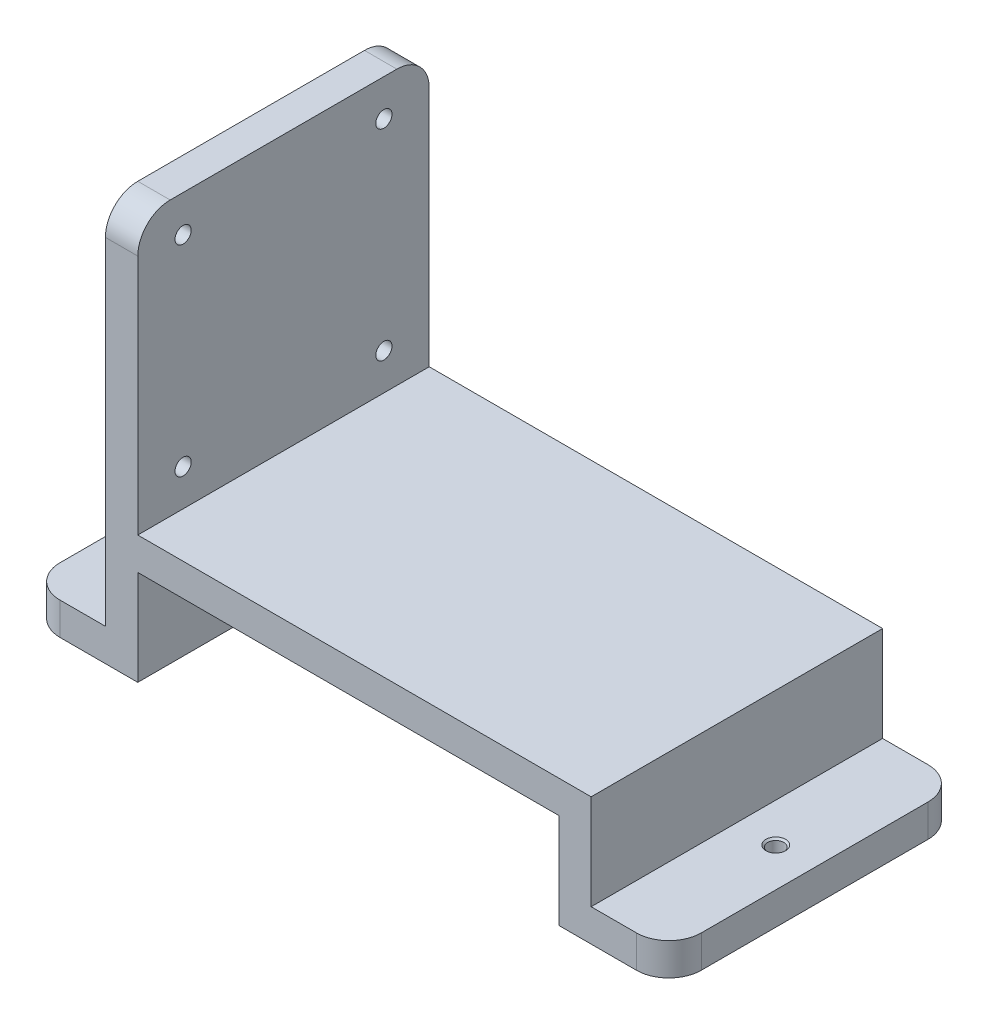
ISO-10303-21;
HEADER;
FILE_DESCRIPTION(('STEP AP214'),'2;1');
FILE_NAME('part.step','',(''),(''),'','','');
FILE_SCHEMA(('AUTOMOTIVE_DESIGN { 1 0 10303 214 1 1 1 1 }'));
ENDSEC;
DATA;
#1=APPLICATION_CONTEXT('core data for automotive mechanical design processes');
#2=APPLICATION_PROTOCOL_DEFINITION('international standard','automotive_design',2000,#1);
#3=PRODUCT_CONTEXT('',#1,'mechanical');
#4=PRODUCT('Part','Part','',(#3));
#5=PRODUCT_RELATED_PRODUCT_CATEGORY('part','',(#4));
#6=PRODUCT_DEFINITION_FORMATION('','',#4);
#7=PRODUCT_DEFINITION_CONTEXT('part definition',#1,'design');
#8=PRODUCT_DEFINITION('design','',#6,#7);
#9=PRODUCT_DEFINITION_SHAPE('','',#8);
#10=(LENGTH_UNIT() NAMED_UNIT(*) SI_UNIT(.MILLI.,.METRE.));
#11=(NAMED_UNIT(*) PLANE_ANGLE_UNIT() SI_UNIT($,.RADIAN.));
#12=(NAMED_UNIT(*) SI_UNIT($,.STERADIAN.) SOLID_ANGLE_UNIT());
#13=UNCERTAINTY_MEASURE_WITH_UNIT(LENGTH_MEASURE(1.E-05),#10,'distance_accuracy_value','');
#14=(GEOMETRIC_REPRESENTATION_CONTEXT(3) GLOBAL_UNCERTAINTY_ASSIGNED_CONTEXT((#13)) GLOBAL_UNIT_ASSIGNED_CONTEXT((#10,
#11,#12)) REPRESENTATION_CONTEXT('',''));
#15=CARTESIAN_POINT('',(0.,0.,0.));
#16=DIRECTION('',(0.,0.,1.));
#17=DIRECTION('',(1.,0.,0.));
#18=AXIS2_PLACEMENT_3D('',#15,#16,#17);
#19=CARTESIAN_POINT('',(-37.5,-9.7,45.));
#20=DIRECTION('',(1.,0.,0.));
#21=DIRECTION('',(0.,0.,-1.));
#22=AXIS2_PLACEMENT_3D('',#19,#20,#21);
#23=PLANE('',#22);
#24=CARTESIAN_POINT('',(-37.5,41.65,7.00000000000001));
#25=DIRECTION('',(-1.,0.,0.));
#26=DIRECTION('',(0.,0.,1.));
#27=AXIS2_PLACEMENT_3D('',#24,#25,#26);
#28=CIRCLE('',#27,1.525);
#29=CARTESIAN_POINT('',(-37.5,41.65,8.52500000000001));
#30=VERTEX_POINT('',#29);
#31=EDGE_CURVE('E754',#30,#30,#28,.T.);
#32=ORIENTED_EDGE('',*,*,#31,.F.);
#33=EDGE_LOOP('',(#32));
#34=FACE_BOUND('',#33,.T.);
#35=CARTESIAN_POINT('',(-37.5,10.65,7.));
#36=DIRECTION('',(-1.,0.,0.));
#37=DIRECTION('',(0.,0.,1.));
#38=AXIS2_PLACEMENT_3D('',#35,#36,#37);
#39=CIRCLE('',#38,1.525);
#40=CARTESIAN_POINT('',(-37.5,10.65,8.525));
#41=VERTEX_POINT('',#40);
#42=EDGE_CURVE('E364',#41,#41,#39,.T.);
#43=ORIENTED_EDGE('',*,*,#42,.F.);
#44=EDGE_LOOP('',(#43));
#45=FACE_BOUND('',#44,.T.);
#46=CARTESIAN_POINT('',(-37.5,41.65,38.));
#47=DIRECTION('',(-1.,0.,0.));
#48=DIRECTION('',(0.,0.,1.));
#49=AXIS2_PLACEMENT_3D('',#46,#47,#48);
#50=CIRCLE('',#49,1.525);
#51=CARTESIAN_POINT('',(-37.5,41.65,39.525));
#52=VERTEX_POINT('',#51);
#53=EDGE_CURVE('E353',#52,#52,#50,.T.);
#54=ORIENTED_EDGE('',*,*,#53,.F.);
#55=EDGE_LOOP('',(#54));
#56=FACE_BOUND('',#55,.T.);
#57=DIRECTION('',(0.,0.,-1.));
#58=VECTOR('',#57,1.);
#59=CARTESIAN_POINT('',(-37.5,47.3,45.));
#60=LINE('',#59,#58);
#61=CARTESIAN_POINT('',(-37.5,47.3,40.));
#62=VERTEX_POINT('',#61);
#63=CARTESIAN_POINT('',(-37.5,47.3,5.00000000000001));
#64=VERTEX_POINT('',#63);
#65=EDGE_CURVE('E208',#62,#64,#60,.T.);
#66=ORIENTED_EDGE('',*,*,#65,.T.);
#67=CARTESIAN_POINT('',(-37.5,42.3,5.));
#68=DIRECTION('',(1.,0.,0.));
#69=DIRECTION('',(0.,0.,-1.));
#70=AXIS2_PLACEMENT_3D('',#67,#68,#69);
#71=CIRCLE('',#70,5.);
#72=CARTESIAN_POINT('',(-37.5,42.3,0.));
#73=VERTEX_POINT('',#72);
#74=EDGE_CURVE('E331',#64,#73,#71,.F.);
#75=ORIENTED_EDGE('',*,*,#74,.T.);
#76=DIRECTION('',(0.,-1.,0.));
#77=VECTOR('',#76,1.);
#78=CARTESIAN_POINT('',(-37.5,-9.7,0.));
#79=LINE('',#78,#77);
#80=CARTESIAN_POINT('',(-37.5,-9.7,0.));
#81=VERTEX_POINT('',#80);
#82=EDGE_CURVE('E206',#73,#81,#79,.T.);
#83=ORIENTED_EDGE('',*,*,#82,.T.);
#84=DIRECTION('',(0.,0.,-1.));
#85=VECTOR('',#84,1.);
#86=CARTESIAN_POINT('',(-37.5,-9.7,45.));
#87=LINE('',#86,#85);
#88=CARTESIAN_POINT('',(-37.5,-9.7,45.));
#89=VERTEX_POINT('',#88);
#90=EDGE_CURVE('E202',#89,#81,#87,.T.);
#91=ORIENTED_EDGE('',*,*,#90,.F.);
#92=DIRECTION('',(0.,-1.,0.));
#93=VECTOR('',#92,1.);
#94=CARTESIAN_POINT('',(-37.5,-9.7,45.));
#95=LINE('',#94,#93);
#96=CARTESIAN_POINT('',(-37.5,42.3,45.));
#97=VERTEX_POINT('',#96);
#98=EDGE_CURVE('E187',#97,#89,#95,.T.);
#99=ORIENTED_EDGE('',*,*,#98,.F.);
#100=CARTESIAN_POINT('',(-37.5,42.3,40.));
#101=DIRECTION('',(1.,0.,0.));
#102=DIRECTION('',(0.,0.,-1.));
#103=AXIS2_PLACEMENT_3D('',#100,#101,#102);
#104=CIRCLE('',#103,5.);
#105=EDGE_CURVE('E329',#97,#62,#104,.F.);
#106=ORIENTED_EDGE('',*,*,#105,.T.);
#107=EDGE_LOOP('',(#66,#75,#83,#91,#99,#106));
#108=FACE_BOUND('',#107,.T.);
#109=CARTESIAN_POINT('',(-37.5,10.65,38.));
#110=DIRECTION('',(-1.,0.,0.));
#111=DIRECTION('',(0.,0.,1.));
#112=AXIS2_PLACEMENT_3D('',#109,#110,#111);
#113=CIRCLE('',#112,1.525);
#114=CARTESIAN_POINT('',(-37.5,10.65,39.525));
#115=VERTEX_POINT('',#114);
#116=EDGE_CURVE('E357',#115,#115,#113,.T.);
#117=ORIENTED_EDGE('',*,*,#116,.F.);
#118=EDGE_LOOP('',(#117));
#119=FACE_BOUND('',#118,.T.);
#120=ADVANCED_FACE('F47',(#34,#45,#56,#108,#119),#23,.F.);
#121=CARTESIAN_POINT('',(-32.5,47.3,45.));
#122=DIRECTION('',(-1.,0.,0.));
#123=DIRECTION('',(0.,-1.,0.));
#124=AXIS2_PLACEMENT_3D('',#121,#122,#123);
#125=PLANE('',#124);
#126=CARTESIAN_POINT('',(-32.5,41.65,7.00000000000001));
#127=DIRECTION('',(-1.,0.,0.));
#128=DIRECTION('',(0.,-1.,0.));
#129=AXIS2_PLACEMENT_3D('',#126,#127,#128);
#130=CIRCLE('',#129,1.24999999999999);
#131=CARTESIAN_POINT('',(-32.5,40.4,7.00000000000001));
#132=VERTEX_POINT('',#131);
#133=EDGE_CURVE('E51',#132,#132,#130,.T.);
#134=ORIENTED_EDGE('',*,*,#133,.T.);
#135=EDGE_LOOP('',(#134));
#136=FACE_BOUND('',#135,.T.);
#137=CARTESIAN_POINT('',(-32.5,10.65,7.));
#138=DIRECTION('',(-1.,0.,0.));
#139=DIRECTION('',(0.,-1.,0.));
#140=AXIS2_PLACEMENT_3D('',#137,#138,#139);
#141=CIRCLE('',#140,1.24999999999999);
#142=CARTESIAN_POINT('',(-32.5,9.40000000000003,7.));
#143=VERTEX_POINT('',#142);
#144=EDGE_CURVE('E355',#143,#143,#141,.T.);
#145=ORIENTED_EDGE('',*,*,#144,.T.);
#146=EDGE_LOOP('',(#145));
#147=FACE_BOUND('',#146,.T.);
#148=CARTESIAN_POINT('',(-32.5,10.65,38.));
#149=DIRECTION('',(-1.,0.,0.));
#150=DIRECTION('',(0.,-1.,0.));
#151=AXIS2_PLACEMENT_3D('',#148,#149,#150);
#152=CIRCLE('',#151,1.24999999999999);
#153=CARTESIAN_POINT('',(-32.5,9.40000000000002,38.));
#154=VERTEX_POINT('',#153);
#155=EDGE_CURVE('E351',#154,#154,#152,.T.);
#156=ORIENTED_EDGE('',*,*,#155,.T.);
#157=EDGE_LOOP('',(#156));
#158=FACE_BOUND('',#157,.T.);
#159=CARTESIAN_POINT('',(-32.5,41.65,38.));
#160=DIRECTION('',(-1.,0.,0.));
#161=DIRECTION('',(0.,-1.,0.));
#162=AXIS2_PLACEMENT_3D('',#159,#160,#161);
#163=CIRCLE('',#162,1.24999999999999);
#164=CARTESIAN_POINT('',(-32.5,40.4,38.));
#165=VERTEX_POINT('',#164);
#166=EDGE_CURVE('E346',#165,#165,#163,.T.);
#167=ORIENTED_EDGE('',*,*,#166,.T.);
#168=EDGE_LOOP('',(#167));
#169=FACE_BOUND('',#168,.T.);
#170=DIRECTION('',(0.,1.,0.));
#171=VECTOR('',#170,1.);
#172=CARTESIAN_POINT('',(-32.5,47.3,0.));
#173=LINE('',#172,#171);
#174=CARTESIAN_POINT('',(-32.5,5.00000000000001,0.));
#175=VERTEX_POINT('',#174);
#176=CARTESIAN_POINT('',(-32.5,42.3,0.));
#177=VERTEX_POINT('',#176);
#178=EDGE_CURVE('E233',#175,#177,#173,.T.);
#179=ORIENTED_EDGE('',*,*,#178,.T.);
#180=CARTESIAN_POINT('',(-32.5,42.3,5.));
#181=DIRECTION('',(-1.,0.,0.));
#182=DIRECTION('',(0.,-1.,0.));
#183=AXIS2_PLACEMENT_3D('',#180,#181,#182);
#184=CIRCLE('',#183,5.);
#185=CARTESIAN_POINT('',(-32.5,47.3,5.00000000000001));
#186=VERTEX_POINT('',#185);
#187=EDGE_CURVE('E335',#177,#186,#184,.F.);
#188=ORIENTED_EDGE('',*,*,#187,.T.);
#189=DIRECTION('',(0.,0.,-1.));
#190=VECTOR('',#189,1.);
#191=CARTESIAN_POINT('',(-32.5,47.3,45.));
#192=LINE('',#191,#190);
#193=CARTESIAN_POINT('',(-32.5,47.3,40.));
#194=VERTEX_POINT('',#193);
#195=EDGE_CURVE('E288',#194,#186,#192,.T.);
#196=ORIENTED_EDGE('',*,*,#195,.F.);
#197=CARTESIAN_POINT('',(-32.5,42.3,40.));
#198=DIRECTION('',(-1.,0.,0.));
#199=DIRECTION('',(0.,-1.,0.));
#200=AXIS2_PLACEMENT_3D('',#197,#198,#199);
#201=CIRCLE('',#200,5.);
#202=CARTESIAN_POINT('',(-32.5,42.3,45.));
#203=VERTEX_POINT('',#202);
#204=EDGE_CURVE('E333',#194,#203,#201,.F.);
#205=ORIENTED_EDGE('',*,*,#204,.T.);
#206=DIRECTION('',(0.,1.,0.));
#207=VECTOR('',#206,1.);
#208=CARTESIAN_POINT('',(-32.5,47.3,45.));
#209=LINE('',#208,#207);
#210=CARTESIAN_POINT('',(-32.5,5.00000000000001,45.));
#211=VERTEX_POINT('',#210);
#212=EDGE_CURVE('E199',#211,#203,#209,.T.);
#213=ORIENTED_EDGE('',*,*,#212,.F.);
#214=DIRECTION('',(0.,0.,-1.));
#215=VECTOR('',#214,1.);
#216=CARTESIAN_POINT('',(-32.5,5.00000000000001,45.));
#217=LINE('',#216,#215);
#218=EDGE_CURVE('E232',#211,#175,#217,.T.);
#219=ORIENTED_EDGE('',*,*,#218,.T.);
#220=EDGE_LOOP('',(#179,#188,#196,#205,#213,#219));
#221=FACE_BOUND('',#220,.T.);
#222=ADVANCED_FACE('F455',(#136,#147,#158,#169,#221),#125,.F.);
#223=CARTESIAN_POINT('',(-37.5,47.3,45.));
#224=DIRECTION('',(0.,-1.,0.));
#225=DIRECTION('',(1.,0.,0.));
#226=AXIS2_PLACEMENT_3D('',#223,#224,#225);
#227=PLANE('',#226);
#228=ORIENTED_EDGE('',*,*,#195,.T.);
#229=DIRECTION('',(-1.,0.,0.));
#230=VECTOR('',#229,1.);
#231=CARTESIAN_POINT('',(-37.5,47.3,5.));
#232=LINE('',#231,#230);
#233=EDGE_CURVE('E326',#186,#64,#232,.T.);
#234=ORIENTED_EDGE('',*,*,#233,.T.);
#235=ORIENTED_EDGE('',*,*,#65,.F.);
#236=DIRECTION('',(-1.,0.,0.));
#237=VECTOR('',#236,1.);
#238=CARTESIAN_POINT('',(-32.5,47.3,40.));
#239=LINE('',#238,#237);
#240=EDGE_CURVE('E324',#62,#194,#239,.F.);
#241=ORIENTED_EDGE('',*,*,#240,.T.);
#242=EDGE_LOOP('',(#228,#234,#235,#241));
#243=FACE_BOUND('',#242,.T.);
#244=ADVANCED_FACE('F395',(#243),#227,.F.);
#245=CARTESIAN_POINT('',(-49.5,-9.7,45.));
#246=DIRECTION('',(0.,-1.,0.));
#247=DIRECTION('',(0.,0.,-1.));
#248=AXIS2_PLACEMENT_3D('',#245,#246,#247);
#249=PLANE('',#248);
#250=CARTESIAN_POINT('',(-43.5,-9.69999999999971,22.5));
#251=DIRECTION('',(0.,1.,0.));
#252=DIRECTION('',(0.,0.,1.));
#253=AXIS2_PLACEMENT_3D('',#250,#251,#252);
#254=CIRCLE('',#253,1.525);
#255=CARTESIAN_POINT('',(-43.5,-9.69999999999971,24.025));
#256=VERTEX_POINT('',#255);
#257=EDGE_CURVE('E298',#256,#256,#254,.T.);
#258=ORIENTED_EDGE('',*,*,#257,.F.);
#259=EDGE_LOOP('',(#258));
#260=FACE_BOUND('',#259,.T.);
#261=DIRECTION('',(-1.,0.,0.));
#262=VECTOR('',#261,1.);
#263=CARTESIAN_POINT('',(-49.5,-9.7,0.));
#264=LINE('',#263,#262);
#265=CARTESIAN_POINT('',(-44.5,-9.7,0.));
#266=VERTEX_POINT('',#265);
#267=EDGE_CURVE('E238',#81,#266,#264,.T.);
#268=ORIENTED_EDGE('',*,*,#267,.T.);
#269=CARTESIAN_POINT('',(-44.5,-9.7,5.));
#270=DIRECTION('',(0.,-1.,0.));
#271=DIRECTION('',(0.,0.,-1.));
#272=AXIS2_PLACEMENT_3D('',#269,#270,#271);
#273=CIRCLE('',#272,5.);
#274=CARTESIAN_POINT('',(-49.5,-9.7,5.00000000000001));
#275=VERTEX_POINT('',#274);
#276=EDGE_CURVE('E11',#266,#275,#273,.F.);
#277=ORIENTED_EDGE('',*,*,#276,.T.);
#278=DIRECTION('',(0.,0.,-1.));
#279=VECTOR('',#278,1.);
#280=CARTESIAN_POINT('',(-49.5,-9.7,45.));
#281=LINE('',#280,#279);
#282=CARTESIAN_POINT('',(-49.5,-9.7,40.));
#283=VERTEX_POINT('',#282);
#284=EDGE_CURVE('E209',#283,#275,#281,.T.);
#285=ORIENTED_EDGE('',*,*,#284,.F.);
#286=CARTESIAN_POINT('',(-44.5,-9.7,40.));
#287=DIRECTION('',(0.,-1.,0.));
#288=DIRECTION('',(0.,0.,-1.));
#289=AXIS2_PLACEMENT_3D('',#286,#287,#288);
#290=CIRCLE('',#289,5.);
#291=CARTESIAN_POINT('',(-44.5,-9.7,45.));
#292=VERTEX_POINT('',#291);
#293=EDGE_CURVE('E56',#283,#292,#290,.F.);
#294=ORIENTED_EDGE('',*,*,#293,.T.);
#295=DIRECTION('',(-1.,0.,0.));
#296=VECTOR('',#295,1.);
#297=CARTESIAN_POINT('',(-49.5,-9.7,45.));
#298=LINE('',#297,#296);
#299=EDGE_CURVE('E193',#89,#292,#298,.T.);
#300=ORIENTED_EDGE('',*,*,#299,.F.);
#301=ORIENTED_EDGE('',*,*,#90,.T.);
#302=EDGE_LOOP('',(#268,#277,#285,#294,#300,#301));
#303=FACE_BOUND('',#302,.T.);
#304=ADVANCED_FACE('F211',(#260,#303),#249,.F.);
#305=CARTESIAN_POINT('',(-49.5,-14.7,45.));
#306=DIRECTION('',(1.,0.,0.));
#307=DIRECTION('',(0.,0.,-1.));
#308=AXIS2_PLACEMENT_3D('',#305,#306,#307);
#309=PLANE('',#308);
#310=ORIENTED_EDGE('',*,*,#284,.T.);
#311=DIRECTION('',(0.,-1.,0.));
#312=VECTOR('',#311,1.);
#313=CARTESIAN_POINT('',(-49.5,-14.7,5.));
#314=LINE('',#313,#312);
#315=CARTESIAN_POINT('',(-49.5,-14.7,5.00000000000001));
#316=VERTEX_POINT('',#315);
#317=EDGE_CURVE('E338',#275,#316,#314,.T.);
#318=ORIENTED_EDGE('',*,*,#317,.T.);
#319=DIRECTION('',(0.,0.,-1.));
#320=VECTOR('',#319,1.);
#321=CARTESIAN_POINT('',(-49.5,-14.7,45.));
#322=LINE('',#321,#320);
#323=CARTESIAN_POINT('',(-49.5,-14.7,40.));
#324=VERTEX_POINT('',#323);
#325=EDGE_CURVE('E283',#324,#316,#322,.T.);
#326=ORIENTED_EDGE('',*,*,#325,.F.);
#327=DIRECTION('',(0.,-1.,0.));
#328=VECTOR('',#327,1.);
#329=CARTESIAN_POINT('',(-49.5,-9.7,40.));
#330=LINE('',#329,#328);
#331=EDGE_CURVE('E69',#324,#283,#330,.F.);
#332=ORIENTED_EDGE('',*,*,#331,.T.);
#333=EDGE_LOOP('',(#310,#318,#326,#332));
#334=FACE_BOUND('',#333,.T.);
#335=ADVANCED_FACE('F411',(#334),#309,.F.);
#336=CARTESIAN_POINT('',(-32.5,-14.7,45.));
#337=DIRECTION('',(0.,1.,0.));
#338=DIRECTION('',(-1.,0.,0.));
#339=AXIS2_PLACEMENT_3D('',#336,#337,#338);
#340=PLANE('',#339);
#341=CARTESIAN_POINT('',(-43.5,-14.7,22.5));
#342=DIRECTION('',(0.,1.,0.));
#343=DIRECTION('',(-1.,0.,0.));
#344=AXIS2_PLACEMENT_3D('',#341,#342,#343);
#345=CIRCLE('',#344,1.25);
#346=CARTESIAN_POINT('',(-44.75,-14.7,22.5));
#347=VERTEX_POINT('',#346);
#348=EDGE_CURVE('E236',#347,#347,#345,.T.);
#349=ORIENTED_EDGE('',*,*,#348,.T.);
#350=EDGE_LOOP('',(#349));
#351=FACE_BOUND('',#350,.T.);
#352=ORIENTED_EDGE('',*,*,#325,.T.);
#353=CARTESIAN_POINT('',(-44.5,-14.7,5.));
#354=DIRECTION('',(0.,1.,0.));
#355=DIRECTION('',(-1.,0.,0.));
#356=AXIS2_PLACEMENT_3D('',#353,#354,#355);
#357=CIRCLE('',#356,5.);
#358=CARTESIAN_POINT('',(-44.5,-14.7,0.));
#359=VERTEX_POINT('',#358);
#360=EDGE_CURVE('E343',#316,#359,#357,.F.);
#361=ORIENTED_EDGE('',*,*,#360,.T.);
#362=DIRECTION('',(1.,0.,0.));
#363=VECTOR('',#362,1.);
#364=CARTESIAN_POINT('',(-32.5,-14.7,0.));
#365=LINE('',#364,#363);
#366=CARTESIAN_POINT('',(-32.5,-14.7,0.));
#367=VERTEX_POINT('',#366);
#368=EDGE_CURVE('E240',#359,#367,#365,.T.);
#369=ORIENTED_EDGE('',*,*,#368,.T.);
#370=DIRECTION('',(0.,0.,-1.));
#371=VECTOR('',#370,1.);
#372=CARTESIAN_POINT('',(-32.5,-14.7,45.));
#373=LINE('',#372,#371);
#374=CARTESIAN_POINT('',(-32.5,-14.7,45.));
#375=VERTEX_POINT('',#374);
#376=EDGE_CURVE('E280',#375,#367,#373,.T.);
#377=ORIENTED_EDGE('',*,*,#376,.F.);
#378=DIRECTION('',(1.,0.,0.));
#379=VECTOR('',#378,1.);
#380=CARTESIAN_POINT('',(-32.5,-14.7,45.));
#381=LINE('',#380,#379);
#382=CARTESIAN_POINT('',(-44.5,-14.7,45.));
#383=VERTEX_POINT('',#382);
#384=EDGE_CURVE('E213',#383,#375,#381,.T.);
#385=ORIENTED_EDGE('',*,*,#384,.F.);
#386=CARTESIAN_POINT('',(-44.5,-14.7,40.));
#387=DIRECTION('',(0.,1.,0.));
#388=DIRECTION('',(-1.,0.,0.));
#389=AXIS2_PLACEMENT_3D('',#386,#387,#388);
#390=CIRCLE('',#389,5.);
#391=EDGE_CURVE('E341',#383,#324,#390,.F.);
#392=ORIENTED_EDGE('',*,*,#391,.T.);
#393=EDGE_LOOP('',(#352,#361,#369,#377,#385,#392));
#394=FACE_BOUND('',#393,.T.);
#395=ADVANCED_FACE('F413',(#351,#394),#340,.F.);
#396=CARTESIAN_POINT('',(-32.5,0.,45.));
#397=DIRECTION('',(-1.,0.,0.));
#398=DIRECTION('',(0.,-1.,0.));
#399=AXIS2_PLACEMENT_3D('',#396,#397,#398);
#400=PLANE('',#399);
#401=DIRECTION('',(0.,1.,0.));
#402=VECTOR('',#401,1.);
#403=CARTESIAN_POINT('',(-32.5,0.,0.));
#404=LINE('',#403,#402);
#405=CARTESIAN_POINT('',(-32.5,0.,0.));
#406=VERTEX_POINT('',#405);
#407=EDGE_CURVE('E242',#367,#406,#404,.T.);
#408=ORIENTED_EDGE('',*,*,#407,.T.);
#409=DIRECTION('',(0.,0.,-1.));
#410=VECTOR('',#409,1.);
#411=CARTESIAN_POINT('',(-32.5,0.,45.));
#412=LINE('',#411,#410);
#413=CARTESIAN_POINT('',(-32.5,0.,45.));
#414=VERTEX_POINT('',#413);
#415=EDGE_CURVE('E277',#414,#406,#412,.T.);
#416=ORIENTED_EDGE('',*,*,#415,.F.);
#417=DIRECTION('',(0.,1.,0.));
#418=VECTOR('',#417,1.);
#419=CARTESIAN_POINT('',(-32.5,0.,45.));
#420=LINE('',#419,#418);
#421=EDGE_CURVE('E215',#375,#414,#420,.T.);
#422=ORIENTED_EDGE('',*,*,#421,.F.);
#423=ORIENTED_EDGE('',*,*,#376,.T.);
#424=EDGE_LOOP('',(#408,#416,#422,#423));
#425=FACE_BOUND('',#424,.T.);
#426=ADVANCED_FACE('F421',(#425),#400,.F.);
#427=CARTESIAN_POINT('',(-32.5,0.,45.));
#428=DIRECTION('',(0.,1.,0.));
#429=DIRECTION('',(0.,0.,1.));
#430=AXIS2_PLACEMENT_3D('',#427,#428,#429);
#431=PLANE('',#430);
#432=DIRECTION('',(1.,0.,0.));
#433=VECTOR('',#432,1.);
#434=CARTESIAN_POINT('',(-32.5,0.,0.));
#435=LINE('',#434,#433);
#436=CARTESIAN_POINT('',(32.5,0.,0.));
#437=VERTEX_POINT('',#436);
#438=EDGE_CURVE('E244',#406,#437,#435,.T.);
#439=ORIENTED_EDGE('',*,*,#438,.T.);
#440=DIRECTION('',(0.,0.,-1.));
#441=VECTOR('',#440,1.);
#442=CARTESIAN_POINT('',(32.5,0.,45.));
#443=LINE('',#442,#441);
#444=CARTESIAN_POINT('',(32.5,0.,45.));
#445=VERTEX_POINT('',#444);
#446=EDGE_CURVE('E274',#445,#437,#443,.T.);
#447=ORIENTED_EDGE('',*,*,#446,.F.);
#448=DIRECTION('',(1.,0.,0.));
#449=VECTOR('',#448,1.);
#450=CARTESIAN_POINT('',(-32.5,0.,45.));
#451=LINE('',#450,#449);
#452=EDGE_CURVE('E220',#414,#445,#451,.T.);
#453=ORIENTED_EDGE('',*,*,#452,.F.);
#454=ORIENTED_EDGE('',*,*,#415,.T.);
#455=EDGE_LOOP('',(#439,#447,#453,#454));
#456=FACE_BOUND('',#455,.T.);
#457=ADVANCED_FACE('F426',(#456),#431,.F.);
#458=CARTESIAN_POINT('',(32.5,-14.7,45.));
#459=DIRECTION('',(1.,0.,0.));
#460=DIRECTION('',(0.,1.,0.));
#461=AXIS2_PLACEMENT_3D('',#458,#459,#460);
#462=PLANE('',#461);
#463=DIRECTION('',(0.,-1.,0.));
#464=VECTOR('',#463,1.);
#465=CARTESIAN_POINT('',(32.5,-14.7,0.));
#466=LINE('',#465,#464);
#467=CARTESIAN_POINT('',(32.5,-14.7,0.));
#468=VERTEX_POINT('',#467);
#469=EDGE_CURVE('E246',#437,#468,#466,.T.);
#470=ORIENTED_EDGE('',*,*,#469,.T.);
#471=DIRECTION('',(0.,0.,-1.));
#472=VECTOR('',#471,1.);
#473=CARTESIAN_POINT('',(32.5,-14.7,45.));
#474=LINE('',#473,#472);
#475=CARTESIAN_POINT('',(32.5,-14.7,45.));
#476=VERTEX_POINT('',#475);
#477=EDGE_CURVE('E271',#476,#468,#474,.T.);
#478=ORIENTED_EDGE('',*,*,#477,.F.);
#479=DIRECTION('',(0.,-1.,0.));
#480=VECTOR('',#479,1.);
#481=CARTESIAN_POINT('',(32.5,-14.7,45.));
#482=LINE('',#481,#480);
#483=EDGE_CURVE('E222',#445,#476,#482,.T.);
#484=ORIENTED_EDGE('',*,*,#483,.F.);
#485=ORIENTED_EDGE('',*,*,#446,.T.);
#486=EDGE_LOOP('',(#470,#478,#484,#485));
#487=FACE_BOUND('',#486,.T.);
#488=ADVANCED_FACE('F432',(#487),#462,.F.);
#489=CARTESIAN_POINT('',(49.5,-14.7,45.));
#490=DIRECTION('',(0.,1.,0.));
#491=DIRECTION('',(-1.,0.,0.));
#492=AXIS2_PLACEMENT_3D('',#489,#490,#491);
#493=PLANE('',#492);
#494=CARTESIAN_POINT('',(43.5,-14.7,22.5));
#495=DIRECTION('',(0.,1.,0.));
#496=DIRECTION('',(-1.,0.,0.));
#497=AXIS2_PLACEMENT_3D('',#494,#495,#496);
#498=CIRCLE('',#497,1.25);
#499=CARTESIAN_POINT('',(42.25,-14.7,22.5));
#500=VERTEX_POINT('',#499);
#501=EDGE_CURVE('E295',#500,#500,#498,.T.);
#502=ORIENTED_EDGE('',*,*,#501,.T.);
#503=EDGE_LOOP('',(#502));
#504=FACE_BOUND('',#503,.T.);
#505=DIRECTION('',(1.,0.,0.));
#506=VECTOR('',#505,1.);
#507=CARTESIAN_POINT('',(49.5,-14.7,0.));
#508=LINE('',#507,#506);
#509=CARTESIAN_POINT('',(44.5,-14.7,0.));
#510=VERTEX_POINT('',#509);
#511=EDGE_CURVE('E248',#468,#510,#508,.T.);
#512=ORIENTED_EDGE('',*,*,#511,.T.);
#513=CARTESIAN_POINT('',(44.5,-14.7,5.));
#514=DIRECTION('',(0.,1.,0.));
#515=DIRECTION('',(-1.,0.,0.));
#516=AXIS2_PLACEMENT_3D('',#513,#514,#515);
#517=CIRCLE('',#516,5.);
#518=CARTESIAN_POINT('',(49.5,-14.7,5.00000000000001));
#519=VERTEX_POINT('',#518);
#520=EDGE_CURVE('E316',#510,#519,#517,.F.);
#521=ORIENTED_EDGE('',*,*,#520,.T.);
#522=DIRECTION('',(0.,0.,-1.));
#523=VECTOR('',#522,1.);
#524=CARTESIAN_POINT('',(49.5,-14.7,45.));
#525=LINE('',#524,#523);
#526=CARTESIAN_POINT('',(49.5,-14.7,40.));
#527=VERTEX_POINT('',#526);
#528=EDGE_CURVE('E268',#527,#519,#525,.T.);
#529=ORIENTED_EDGE('',*,*,#528,.F.);
#530=CARTESIAN_POINT('',(44.5,-14.7,40.));
#531=DIRECTION('',(0.,1.,0.));
#532=DIRECTION('',(-1.,0.,0.));
#533=AXIS2_PLACEMENT_3D('',#530,#531,#532);
#534=CIRCLE('',#533,5.);
#535=CARTESIAN_POINT('',(44.5,-14.7,45.));
#536=VERTEX_POINT('',#535);
#537=EDGE_CURVE('E314',#527,#536,#534,.F.);
#538=ORIENTED_EDGE('',*,*,#537,.T.);
#539=DIRECTION('',(1.,0.,0.));
#540=VECTOR('',#539,1.);
#541=CARTESIAN_POINT('',(49.5,-14.7,45.));
#542=LINE('',#541,#540);
#543=EDGE_CURVE('E224',#476,#536,#542,.T.);
#544=ORIENTED_EDGE('',*,*,#543,.F.);
#545=ORIENTED_EDGE('',*,*,#477,.T.);
#546=EDGE_LOOP('',(#512,#521,#529,#538,#544,#545));
#547=FACE_BOUND('',#546,.T.);
#548=ADVANCED_FACE('F436',(#504,#547),#493,.F.);
#549=CARTESIAN_POINT('',(49.5,-9.7,45.));
#550=DIRECTION('',(-1.,0.,0.));
#551=DIRECTION('',(0.,0.,1.));
#552=AXIS2_PLACEMENT_3D('',#549,#550,#551);
#553=PLANE('',#552);
#554=ORIENTED_EDGE('',*,*,#528,.T.);
#555=DIRECTION('',(0.,1.,0.));
#556=VECTOR('',#555,1.);
#557=CARTESIAN_POINT('',(49.5,-9.7,5.));
#558=LINE('',#557,#556);
#559=CARTESIAN_POINT('',(49.5,-9.7,5.00000000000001));
#560=VERTEX_POINT('',#559);
#561=EDGE_CURVE('E301',#519,#560,#558,.T.);
#562=ORIENTED_EDGE('',*,*,#561,.T.);
#563=DIRECTION('',(0.,0.,-1.));
#564=VECTOR('',#563,1.);
#565=CARTESIAN_POINT('',(49.5,-9.7,45.));
#566=LINE('',#565,#564);
#567=CARTESIAN_POINT('',(49.5,-9.7,40.));
#568=VERTEX_POINT('',#567);
#569=EDGE_CURVE('E265',#568,#560,#566,.T.);
#570=ORIENTED_EDGE('',*,*,#569,.F.);
#571=DIRECTION('',(0.,1.,0.));
#572=VECTOR('',#571,1.);
#573=CARTESIAN_POINT('',(49.5,-14.7,40.));
#574=LINE('',#573,#572);
#575=EDGE_CURVE('E291',#568,#527,#574,.F.);
#576=ORIENTED_EDGE('',*,*,#575,.T.);
#577=EDGE_LOOP('',(#554,#562,#570,#576));
#578=FACE_BOUND('',#577,.T.);
#579=ADVANCED_FACE('F462',(#578),#553,.F.);
#580=CARTESIAN_POINT('',(37.5,-9.69999999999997,45.));
#581=DIRECTION('',(0.,-1.,0.));
#582=DIRECTION('',(1.,0.,0.));
#583=AXIS2_PLACEMENT_3D('',#580,#581,#582);
#584=PLANE('',#583);
#585=CARTESIAN_POINT('',(43.5,-9.69999999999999,22.5));
#586=DIRECTION('',(0.,1.,0.));
#587=DIRECTION('',(0.,0.,1.));
#588=AXIS2_PLACEMENT_3D('',#585,#586,#587);
#589=CIRCLE('',#588,1.525);
#590=CARTESIAN_POINT('',(43.5,-9.69999999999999,24.025));
#591=VERTEX_POINT('',#590);
#592=EDGE_CURVE('E349',#591,#591,#589,.T.);
#593=ORIENTED_EDGE('',*,*,#592,.F.);
#594=EDGE_LOOP('',(#593));
#595=FACE_BOUND('',#594,.T.);
#596=ORIENTED_EDGE('',*,*,#569,.T.);
#597=CARTESIAN_POINT('',(44.5,-9.69999999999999,5.));
#598=DIRECTION('',(0.,-1.,0.));
#599=DIRECTION('',(1.,0.,0.));
#600=AXIS2_PLACEMENT_3D('',#597,#598,#599);
#601=CIRCLE('',#600,5.);
#602=CARTESIAN_POINT('',(44.5,-9.69999999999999,0.));
#603=VERTEX_POINT('',#602);
#604=EDGE_CURVE('E306',#560,#603,#601,.F.);
#605=ORIENTED_EDGE('',*,*,#604,.T.);
#606=DIRECTION('',(-1.,0.,0.));
#607=VECTOR('',#606,1.);
#608=CARTESIAN_POINT('',(37.5,-9.69999999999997,0.));
#609=LINE('',#608,#607);
#610=CARTESIAN_POINT('',(37.5,-9.69999999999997,0.));
#611=VERTEX_POINT('',#610);
#612=EDGE_CURVE('E251',#603,#611,#609,.T.);
#613=ORIENTED_EDGE('',*,*,#612,.T.);
#614=DIRECTION('',(0.,0.,-1.));
#615=VECTOR('',#614,1.);
#616=CARTESIAN_POINT('',(37.5,-9.69999999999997,45.));
#617=LINE('',#616,#615);
#618=CARTESIAN_POINT('',(37.5,-9.69999999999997,45.));
#619=VERTEX_POINT('',#618);
#620=EDGE_CURVE('E262',#619,#611,#617,.T.);
#621=ORIENTED_EDGE('',*,*,#620,.F.);
#622=DIRECTION('',(-1.,0.,0.));
#623=VECTOR('',#622,1.);
#624=CARTESIAN_POINT('',(37.5,-9.69999999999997,45.));
#625=LINE('',#624,#623);
#626=CARTESIAN_POINT('',(44.5,-9.69999999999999,45.));
#627=VERTEX_POINT('',#626);
#628=EDGE_CURVE('E226',#627,#619,#625,.T.);
#629=ORIENTED_EDGE('',*,*,#628,.F.);
#630=CARTESIAN_POINT('',(44.5,-9.69999999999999,40.));
#631=DIRECTION('',(0.,-1.,0.));
#632=DIRECTION('',(1.,0.,0.));
#633=AXIS2_PLACEMENT_3D('',#630,#631,#632);
#634=CIRCLE('',#633,5.);
#635=EDGE_CURVE('E304',#627,#568,#634,.F.);
#636=ORIENTED_EDGE('',*,*,#635,.T.);
#637=EDGE_LOOP('',(#596,#605,#613,#621,#629,#636));
#638=FACE_BOUND('',#637,.T.);
#639=ADVANCED_FACE('F445',(#595,#638),#584,.F.);
#640=CARTESIAN_POINT('',(37.5,5.,45.));
#641=DIRECTION('',(-1.,0.,0.));
#642=DIRECTION('',(0.,0.,1.));
#643=AXIS2_PLACEMENT_3D('',#640,#641,#642);
#644=PLANE('',#643);
#645=DIRECTION('',(0.,1.,0.));
#646=VECTOR('',#645,1.);
#647=CARTESIAN_POINT('',(37.5,5.,0.));
#648=LINE('',#647,#646);
#649=CARTESIAN_POINT('',(37.5,5.,0.));
#650=VERTEX_POINT('',#649);
#651=EDGE_CURVE('E253',#611,#650,#648,.T.);
#652=ORIENTED_EDGE('',*,*,#651,.T.);
#653=DIRECTION('',(0.,0.,-1.));
#654=VECTOR('',#653,1.);
#655=CARTESIAN_POINT('',(37.5,5.,45.));
#656=LINE('',#655,#654);
#657=CARTESIAN_POINT('',(37.5,5.,45.));
#658=VERTEX_POINT('',#657);
#659=EDGE_CURVE('E259',#658,#650,#656,.T.);
#660=ORIENTED_EDGE('',*,*,#659,.F.);
#661=DIRECTION('',(0.,1.,0.));
#662=VECTOR('',#661,1.);
#663=CARTESIAN_POINT('',(37.5,5.,45.));
#664=LINE('',#663,#662);
#665=EDGE_CURVE('E228',#619,#658,#664,.T.);
#666=ORIENTED_EDGE('',*,*,#665,.F.);
#667=ORIENTED_EDGE('',*,*,#620,.T.);
#668=EDGE_LOOP('',(#652,#660,#666,#667));
#669=FACE_BOUND('',#668,.T.);
#670=ADVANCED_FACE('F451',(#669),#644,.F.);
#671=CARTESIAN_POINT('',(-32.5,5.00000000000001,45.));
#672=DIRECTION('',(0.,-1.,0.));
#673=DIRECTION('',(1.,0.,0.));
#674=AXIS2_PLACEMENT_3D('',#671,#672,#673);
#675=PLANE('',#674);
#676=DIRECTION('',(-1.,0.,0.));
#677=VECTOR('',#676,1.);
#678=CARTESIAN_POINT('',(-32.5,5.00000000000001,0.));
#679=LINE('',#678,#677);
#680=EDGE_CURVE('E255',#650,#175,#679,.T.);
#681=ORIENTED_EDGE('',*,*,#680,.T.);
#682=ORIENTED_EDGE('',*,*,#218,.F.);
#683=DIRECTION('',(-1.,0.,0.));
#684=VECTOR('',#683,1.);
#685=CARTESIAN_POINT('',(-32.5,5.00000000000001,45.));
#686=LINE('',#685,#684);
#687=EDGE_CURVE('E230',#658,#211,#686,.T.);
#688=ORIENTED_EDGE('',*,*,#687,.F.);
#689=ORIENTED_EDGE('',*,*,#659,.T.);
#690=EDGE_LOOP('',(#681,#682,#688,#689));
#691=FACE_BOUND('',#690,.T.);
#692=ADVANCED_FACE('F454',(#691),#675,.F.);
#693=CARTESIAN_POINT('',(0.,0.,45.));
#694=DIRECTION('',(0.,0.,1.));
#695=DIRECTION('',(1.,0.,0.));
#696=AXIS2_PLACEMENT_3D('',#693,#694,#695);
#697=PLANE('',#696);
#698=ORIENTED_EDGE('',*,*,#543,.T.);
#699=DIRECTION('',(0.,1.,0.));
#700=VECTOR('',#699,1.);
#701=CARTESIAN_POINT('',(44.5,-9.7,45.));
#702=LINE('',#701,#700);
#703=EDGE_CURVE('E321',#536,#627,#702,.T.);
#704=ORIENTED_EDGE('',*,*,#703,.T.);
#705=ORIENTED_EDGE('',*,*,#628,.T.);
#706=ORIENTED_EDGE('',*,*,#665,.T.);
#707=ORIENTED_EDGE('',*,*,#687,.T.);
#708=ORIENTED_EDGE('',*,*,#212,.T.);
#709=DIRECTION('',(-1.,0.,0.));
#710=VECTOR('',#709,1.);
#711=CARTESIAN_POINT('',(-37.5,42.3,45.));
#712=LINE('',#711,#710);
#713=EDGE_CURVE('E197',#203,#97,#712,.T.);
#714=ORIENTED_EDGE('',*,*,#713,.T.);
#715=ORIENTED_EDGE('',*,*,#98,.T.);
#716=ORIENTED_EDGE('',*,*,#299,.T.);
#717=DIRECTION('',(0.,-1.,0.));
#718=VECTOR('',#717,1.);
#719=CARTESIAN_POINT('',(-44.5,-14.7,45.));
#720=LINE('',#719,#718);
#721=EDGE_CURVE('E318',#292,#383,#720,.T.);
#722=ORIENTED_EDGE('',*,*,#721,.T.);
#723=ORIENTED_EDGE('',*,*,#384,.T.);
#724=ORIENTED_EDGE('',*,*,#421,.T.);
#725=ORIENTED_EDGE('',*,*,#452,.T.);
#726=ORIENTED_EDGE('',*,*,#483,.T.);
#727=EDGE_LOOP('',(#698,#704,#705,#706,#707,#708,#714,#715,#716,#722,#723,#724,#725,#726));
#728=FACE_BOUND('',#727,.T.);
#729=ADVANCED_FACE('F190',(#728),#697,.T.);
#730=CARTESIAN_POINT('',(0.,0.,0.));
#731=DIRECTION('',(0.,0.,1.));
#732=DIRECTION('',(1.,0.,0.));
#733=AXIS2_PLACEMENT_3D('',#730,#731,#732);
#734=PLANE('',#733);
#735=ORIENTED_EDGE('',*,*,#612,.F.);
#736=DIRECTION('',(0.,1.,0.));
#737=VECTOR('',#736,1.);
#738=CARTESIAN_POINT('',(44.5,0.,0.));
#739=LINE('',#738,#737);
#740=EDGE_CURVE('E312',#603,#510,#739,.F.);
#741=ORIENTED_EDGE('',*,*,#740,.T.);
#742=ORIENTED_EDGE('',*,*,#511,.F.);
#743=ORIENTED_EDGE('',*,*,#469,.F.);
#744=ORIENTED_EDGE('',*,*,#438,.F.);
#745=ORIENTED_EDGE('',*,*,#407,.F.);
#746=ORIENTED_EDGE('',*,*,#368,.F.);
#747=DIRECTION('',(0.,-1.,0.));
#748=VECTOR('',#747,1.);
#749=CARTESIAN_POINT('',(-44.5,0.,0.));
#750=LINE('',#749,#748);
#751=EDGE_CURVE('E308',#359,#266,#750,.F.);
#752=ORIENTED_EDGE('',*,*,#751,.T.);
#753=ORIENTED_EDGE('',*,*,#267,.F.);
#754=ORIENTED_EDGE('',*,*,#82,.F.);
#755=DIRECTION('',(-1.,0.,0.));
#756=VECTOR('',#755,1.);
#757=CARTESIAN_POINT('',(0.,42.3000000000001,0.));
#758=LINE('',#757,#756);
#759=EDGE_CURVE('E310',#73,#177,#758,.F.);
#760=ORIENTED_EDGE('',*,*,#759,.T.);
#761=ORIENTED_EDGE('',*,*,#178,.F.);
#762=ORIENTED_EDGE('',*,*,#680,.F.);
#763=ORIENTED_EDGE('',*,*,#651,.F.);
#764=EDGE_LOOP('',(#735,#741,#742,#743,#744,#745,#746,#752,#753,#754,#760,#761,#762,#763));
#765=FACE_BOUND('',#764,.T.);
#766=ADVANCED_FACE('F404',(#765),#734,.F.);
#767=CARTESIAN_POINT('',(-43.5,-9.69999999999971,22.5));
#768=DIRECTION('',(0.,1.,0.));
#769=DIRECTION('',(0.,0.,1.));
#770=AXIS2_PLACEMENT_3D('',#767,#768,#769);
#771=CYLINDRICAL_SURFACE('',#770,1.25);
#772=CARTESIAN_POINT('',(-43.5,-9.97499999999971,22.5));
#773=DIRECTION('',(0.,1.,0.));
#774=DIRECTION('',(0.,0.,1.));
#775=AXIS2_PLACEMENT_3D('',#772,#773,#774);
#776=CIRCLE('',#775,1.25);
#777=CARTESIAN_POINT('',(-43.5,-9.97499999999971,23.75));
#778=VERTEX_POINT('',#777);
#779=EDGE_CURVE('E294',#778,#778,#776,.T.);
#780=ORIENTED_EDGE('',*,*,#779,.T.);
#781=EDGE_LOOP('',(#780));
#782=FACE_BOUND('',#781,.T.);
#783=ORIENTED_EDGE('',*,*,#348,.F.);
#784=EDGE_LOOP('',(#783));
#785=FACE_BOUND('',#784,.T.);
#786=ADVANCED_FACE('F527',(#782,#785),#771,.F.);
#787=CARTESIAN_POINT('',(-43.5,-9.69999999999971,22.5));
#788=DIRECTION('',(0.,1.,0.));
#789=DIRECTION('',(0.,0.,1.));
#790=AXIS2_PLACEMENT_3D('',#787,#788,#789);
#791=CONICAL_SURFACE('',#790,1.525,0.785398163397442);
#792=ORIENTED_EDGE('',*,*,#779,.F.);
#793=EDGE_LOOP('',(#792));
#794=FACE_BOUND('',#793,.T.);
#795=ORIENTED_EDGE('',*,*,#257,.T.);
#796=EDGE_LOOP('',(#795));
#797=FACE_BOUND('',#796,.T.);
#798=ADVANCED_FACE('F523',(#794,#797),#791,.F.);
#799=CARTESIAN_POINT('',(43.5,-9.69999999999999,22.5));
#800=DIRECTION('',(0.,1.,0.));
#801=DIRECTION('',(0.,0.,1.));
#802=AXIS2_PLACEMENT_3D('',#799,#800,#801);
#803=CYLINDRICAL_SURFACE('',#802,1.25);
#804=CARTESIAN_POINT('',(43.5,-9.97499999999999,22.5));
#805=DIRECTION('',(0.,1.,0.));
#806=DIRECTION('',(0.,0.,1.));
#807=AXIS2_PLACEMENT_3D('',#804,#805,#806);
#808=CIRCLE('',#807,1.25);
#809=CARTESIAN_POINT('',(43.5,-9.97499999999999,23.75));
#810=VERTEX_POINT('',#809);
#811=EDGE_CURVE('E299',#810,#810,#808,.T.);
#812=ORIENTED_EDGE('',*,*,#811,.T.);
#813=EDGE_LOOP('',(#812));
#814=FACE_BOUND('',#813,.T.);
#815=ORIENTED_EDGE('',*,*,#501,.F.);
#816=EDGE_LOOP('',(#815));
#817=FACE_BOUND('',#816,.T.);
#818=ADVANCED_FACE('F520',(#814,#817),#803,.F.);
#819=CARTESIAN_POINT('',(43.5,-9.69999999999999,22.5));
#820=DIRECTION('',(0.,1.,0.));
#821=DIRECTION('',(0.,0.,1.));
#822=AXIS2_PLACEMENT_3D('',#819,#820,#821);
#823=CONICAL_SURFACE('',#822,1.525,0.785398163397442);
#824=ORIENTED_EDGE('',*,*,#811,.F.);
#825=EDGE_LOOP('',(#824));
#826=FACE_BOUND('',#825,.T.);
#827=ORIENTED_EDGE('',*,*,#592,.T.);
#828=EDGE_LOOP('',(#827));
#829=FACE_BOUND('',#828,.T.);
#830=ADVANCED_FACE('F491',(#826,#829),#823,.F.);
#831=CARTESIAN_POINT('',(44.5,-9.7,5.));
#832=DIRECTION('',(0.,1.,0.));
#833=DIRECTION('',(0.,0.,1.));
#834=AXIS2_PLACEMENT_3D('',#831,#832,#833);
#835=CYLINDRICAL_SURFACE('',#834,5.);
#836=ORIENTED_EDGE('',*,*,#520,.F.);
#837=ORIENTED_EDGE('',*,*,#740,.F.);
#838=ORIENTED_EDGE('',*,*,#604,.F.);
#839=ORIENTED_EDGE('',*,*,#561,.F.);
#840=EDGE_LOOP('',(#836,#837,#838,#839));
#841=FACE_BOUND('',#840,.T.);
#842=ADVANCED_FACE('F459',(#841),#835,.T.);
#843=CARTESIAN_POINT('',(44.5,0.,40.));
#844=DIRECTION('',(0.,-1.,0.));
#845=DIRECTION('',(0.,0.,-1.));
#846=AXIS2_PLACEMENT_3D('',#843,#844,#845);
#847=CYLINDRICAL_SURFACE('',#846,5.);
#848=ORIENTED_EDGE('',*,*,#537,.F.);
#849=ORIENTED_EDGE('',*,*,#575,.F.);
#850=ORIENTED_EDGE('',*,*,#635,.F.);
#851=ORIENTED_EDGE('',*,*,#703,.F.);
#852=EDGE_LOOP('',(#848,#849,#850,#851));
#853=FACE_BOUND('',#852,.T.);
#854=ADVANCED_FACE('F441',(#853),#847,.T.);
#855=CARTESIAN_POINT('',(-37.5,42.3,5.));
#856=DIRECTION('',(-1.,0.,0.));
#857=DIRECTION('',(0.,-1.,0.));
#858=AXIS2_PLACEMENT_3D('',#855,#856,#857);
#859=CYLINDRICAL_SURFACE('',#858,5.);
#860=ORIENTED_EDGE('',*,*,#187,.F.);
#861=ORIENTED_EDGE('',*,*,#759,.F.);
#862=ORIENTED_EDGE('',*,*,#74,.F.);
#863=ORIENTED_EDGE('',*,*,#233,.F.);
#864=EDGE_LOOP('',(#860,#861,#862,#863));
#865=FACE_BOUND('',#864,.T.);
#866=ADVANCED_FACE('F400',(#865),#859,.T.);
#867=CARTESIAN_POINT('',(0.,42.3000000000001,40.));
#868=DIRECTION('',(1.,0.,0.));
#869=DIRECTION('',(0.,1.,0.));
#870=AXIS2_PLACEMENT_3D('',#867,#868,#869);
#871=CYLINDRICAL_SURFACE('',#870,5.);
#872=ORIENTED_EDGE('',*,*,#204,.F.);
#873=ORIENTED_EDGE('',*,*,#240,.F.);
#874=ORIENTED_EDGE('',*,*,#105,.F.);
#875=ORIENTED_EDGE('',*,*,#713,.F.);
#876=EDGE_LOOP('',(#872,#873,#874,#875));
#877=FACE_BOUND('',#876,.T.);
#878=ADVANCED_FACE('F391',(#877),#871,.T.);
#879=CARTESIAN_POINT('',(-44.5,-14.7,5.));
#880=DIRECTION('',(0.,-1.,0.));
#881=DIRECTION('',(0.,0.,-1.));
#882=AXIS2_PLACEMENT_3D('',#879,#880,#881);
#883=CYLINDRICAL_SURFACE('',#882,5.);
#884=ORIENTED_EDGE('',*,*,#276,.F.);
#885=ORIENTED_EDGE('',*,*,#751,.F.);
#886=ORIENTED_EDGE('',*,*,#360,.F.);
#887=ORIENTED_EDGE('',*,*,#317,.F.);
#888=EDGE_LOOP('',(#884,#885,#886,#887));
#889=FACE_BOUND('',#888,.T.);
#890=ADVANCED_FACE('F410',(#889),#883,.T.);
#891=CARTESIAN_POINT('',(-44.5,0.,40.));
#892=DIRECTION('',(0.,1.,0.));
#893=DIRECTION('',(0.,0.,1.));
#894=AXIS2_PLACEMENT_3D('',#891,#892,#893);
#895=CYLINDRICAL_SURFACE('',#894,5.);
#896=ORIENTED_EDGE('',*,*,#293,.F.);
#897=ORIENTED_EDGE('',*,*,#331,.F.);
#898=ORIENTED_EDGE('',*,*,#391,.F.);
#899=ORIENTED_EDGE('',*,*,#721,.F.);
#900=EDGE_LOOP('',(#896,#897,#898,#899));
#901=FACE_BOUND('',#900,.T.);
#902=ADVANCED_FACE('F49',(#901),#895,.T.);
#903=CARTESIAN_POINT('',(-37.5,41.65,38.));
#904=DIRECTION('',(-1.,0.,0.));
#905=DIRECTION('',(0.,0.,1.));
#906=AXIS2_PLACEMENT_3D('',#903,#904,#905);
#907=CYLINDRICAL_SURFACE('',#906,1.24999999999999);
#908=CARTESIAN_POINT('',(-37.225,41.65,38.));
#909=DIRECTION('',(-1.,0.,0.));
#910=DIRECTION('',(0.,0.,1.));
#911=AXIS2_PLACEMENT_3D('',#908,#909,#910);
#912=CIRCLE('',#911,1.24999999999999);
#913=CARTESIAN_POINT('',(-37.225,41.65,39.25));
#914=VERTEX_POINT('',#913);
#915=EDGE_CURVE('E350',#914,#914,#912,.T.);
#916=ORIENTED_EDGE('',*,*,#915,.T.);
#917=EDGE_LOOP('',(#916));
#918=FACE_BOUND('',#917,.T.);
#919=ORIENTED_EDGE('',*,*,#166,.F.);
#920=EDGE_LOOP('',(#919));
#921=FACE_BOUND('',#920,.T.);
#922=ADVANCED_FACE('F500',(#918,#921),#907,.F.);
#923=CARTESIAN_POINT('',(-37.5,41.65,38.));
#924=DIRECTION('',(-1.,0.,0.));
#925=DIRECTION('',(0.,0.,1.));
#926=AXIS2_PLACEMENT_3D('',#923,#924,#925);
#927=CONICAL_SURFACE('',#926,1.525,0.785398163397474);
#928=ORIENTED_EDGE('',*,*,#915,.F.);
#929=EDGE_LOOP('',(#928));
#930=FACE_BOUND('',#929,.T.);
#931=ORIENTED_EDGE('',*,*,#53,.T.);
#932=EDGE_LOOP('',(#931));
#933=FACE_BOUND('',#932,.T.);
#934=ADVANCED_FACE('F504',(#930,#933),#927,.F.);
#935=CARTESIAN_POINT('',(-37.5,10.65,38.));
#936=DIRECTION('',(-1.,0.,0.));
#937=DIRECTION('',(0.,0.,1.));
#938=AXIS2_PLACEMENT_3D('',#935,#936,#937);
#939=CYLINDRICAL_SURFACE('',#938,1.24999999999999);
#940=CARTESIAN_POINT('',(-37.225,10.65,38.));
#941=DIRECTION('',(-1.,0.,0.));
#942=DIRECTION('',(0.,0.,1.));
#943=AXIS2_PLACEMENT_3D('',#940,#941,#942);
#944=CIRCLE('',#943,1.24999999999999);
#945=CARTESIAN_POINT('',(-37.225,10.65,39.25));
#946=VERTEX_POINT('',#945);
#947=EDGE_CURVE('E354',#946,#946,#944,.T.);
#948=ORIENTED_EDGE('',*,*,#947,.T.);
#949=EDGE_LOOP('',(#948));
#950=FACE_BOUND('',#949,.T.);
#951=ORIENTED_EDGE('',*,*,#155,.F.);
#952=EDGE_LOOP('',(#951));
#953=FACE_BOUND('',#952,.T.);
#954=ADVANCED_FACE('F512',(#950,#953),#939,.F.);
#955=CARTESIAN_POINT('',(-37.5,10.65,38.));
#956=DIRECTION('',(-1.,0.,0.));
#957=DIRECTION('',(0.,0.,1.));
#958=AXIS2_PLACEMENT_3D('',#955,#956,#957);
#959=CONICAL_SURFACE('',#958,1.525,0.785398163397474);
#960=ORIENTED_EDGE('',*,*,#947,.F.);
#961=EDGE_LOOP('',(#960));
#962=FACE_BOUND('',#961,.T.);
#963=ORIENTED_EDGE('',*,*,#116,.T.);
#964=EDGE_LOOP('',(#963));
#965=FACE_BOUND('',#964,.T.);
#966=ADVANCED_FACE('F694',(#962,#965),#959,.F.);
#967=CARTESIAN_POINT('',(-37.5,10.65,7.));
#968=DIRECTION('',(-1.,0.,0.));
#969=DIRECTION('',(0.,0.,1.));
#970=AXIS2_PLACEMENT_3D('',#967,#968,#969);
#971=CYLINDRICAL_SURFACE('',#970,1.24999999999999);
#972=CARTESIAN_POINT('',(-37.225,10.65,7.));
#973=DIRECTION('',(-1.,0.,0.));
#974=DIRECTION('',(0.,0.,1.));
#975=AXIS2_PLACEMENT_3D('',#972,#973,#974);
#976=CIRCLE('',#975,1.24999999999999);
#977=CARTESIAN_POINT('',(-37.225,10.65,8.24999999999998));
#978=VERTEX_POINT('',#977);
#979=EDGE_CURVE('E358',#978,#978,#976,.T.);
#980=ORIENTED_EDGE('',*,*,#979,.T.);
#981=EDGE_LOOP('',(#980));
#982=FACE_BOUND('',#981,.T.);
#983=ORIENTED_EDGE('',*,*,#144,.F.);
#984=EDGE_LOOP('',(#983));
#985=FACE_BOUND('',#984,.T.);
#986=ADVANCED_FACE('F704',(#982,#985),#971,.F.);
#987=CARTESIAN_POINT('',(-37.5,10.65,7.));
#988=DIRECTION('',(-1.,0.,0.));
#989=DIRECTION('',(0.,0.,1.));
#990=AXIS2_PLACEMENT_3D('',#987,#988,#989);
#991=CONICAL_SURFACE('',#990,1.525,0.785398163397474);
#992=ORIENTED_EDGE('',*,*,#979,.F.);
#993=EDGE_LOOP('',(#992));
#994=FACE_BOUND('',#993,.T.);
#995=ORIENTED_EDGE('',*,*,#42,.T.);
#996=EDGE_LOOP('',(#995));
#997=FACE_BOUND('',#996,.T.);
#998=ADVANCED_FACE('F715',(#994,#997),#991,.F.);
#999=CARTESIAN_POINT('',(-37.5,41.65,7.00000000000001));
#1000=DIRECTION('',(-1.,0.,0.));
#1001=DIRECTION('',(0.,0.,1.));
#1002=AXIS2_PLACEMENT_3D('',#999,#1000,#1001);
#1003=CYLINDRICAL_SURFACE('',#1002,1.24999999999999);
#1004=CARTESIAN_POINT('',(-37.225,41.65,7.00000000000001));
#1005=DIRECTION('',(-1.,0.,0.));
#1006=DIRECTION('',(0.,0.,1.));
#1007=AXIS2_PLACEMENT_3D('',#1004,#1005,#1006);
#1008=CIRCLE('',#1007,1.24999999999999);
#1009=CARTESIAN_POINT('',(-37.225,41.65,8.24999999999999));
#1010=VERTEX_POINT('',#1009);
#1011=EDGE_CURVE('E752',#1010,#1010,#1008,.T.);
#1012=ORIENTED_EDGE('',*,*,#1011,.T.);
#1013=EDGE_LOOP('',(#1012));
#1014=FACE_BOUND('',#1013,.T.);
#1015=ORIENTED_EDGE('',*,*,#133,.F.);
#1016=EDGE_LOOP('',(#1015));
#1017=FACE_BOUND('',#1016,.T.);
#1018=ADVANCED_FACE('F725',(#1014,#1017),#1003,.F.);
#1019=CARTESIAN_POINT('',(-37.5,41.65,7.00000000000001));
#1020=DIRECTION('',(-1.,0.,0.));
#1021=DIRECTION('',(0.,0.,1.));
#1022=AXIS2_PLACEMENT_3D('',#1019,#1020,#1021);
#1023=CONICAL_SURFACE('',#1022,1.525,0.785398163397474);
#1024=ORIENTED_EDGE('',*,*,#1011,.F.);
#1025=EDGE_LOOP('',(#1024));
#1026=FACE_BOUND('',#1025,.T.);
#1027=ORIENTED_EDGE('',*,*,#31,.T.);
#1028=EDGE_LOOP('',(#1027));
#1029=FACE_BOUND('',#1028,.T.);
#1030=ADVANCED_FACE('F736',(#1026,#1029),#1023,.F.);
#1031=CLOSED_SHELL('',(#120,#222,#244,#304,#335,#395,#426,#457,#488,#548,#579,#639,#670,#692,
#729,#766,#786,#798,#818,#830,#842,#854,#866,#878,#890,#902,#922,#934,#954,#966,#986,#998,#1018,#1030));
#1032=MANIFOLD_SOLID_BREP('B2',#1031);
#1033=ADVANCED_BREP_SHAPE_REPRESENTATION('',(#18,#1032),#14);
#1034=SHAPE_DEFINITION_REPRESENTATION(#9,#1033);
ENDSEC;
END-ISO-10303-21;
